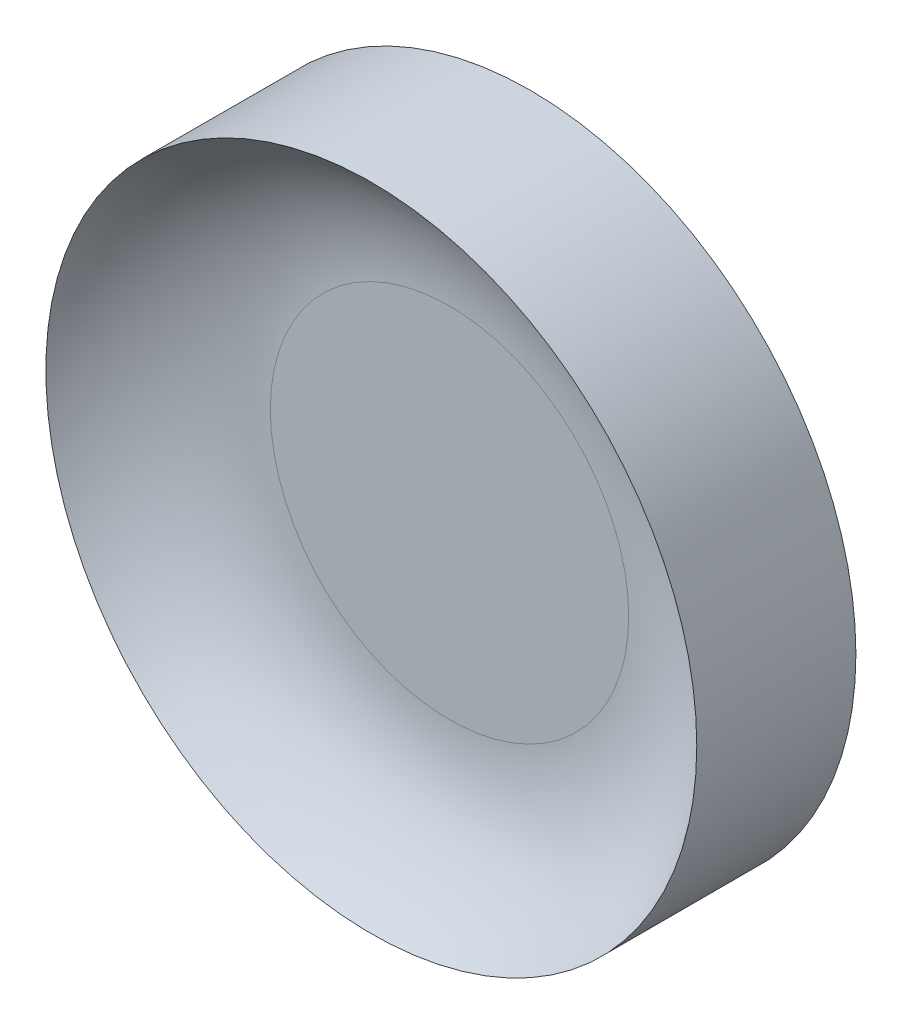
ISO-10303-21;
HEADER;
FILE_DESCRIPTION(('STEP AP214'),'2;1');
FILE_NAME('part.step','',(''),(''),'','','');
FILE_SCHEMA(('AUTOMOTIVE_DESIGN { 1 0 10303 214 1 1 1 1 }'));
ENDSEC;
DATA;
#1=APPLICATION_CONTEXT('core data for automotive mechanical design processes');
#2=APPLICATION_PROTOCOL_DEFINITION('international standard','automotive_design',2000,#1);
#3=PRODUCT_CONTEXT('',#1,'mechanical');
#4=PRODUCT('Part','Part','',(#3));
#5=PRODUCT_RELATED_PRODUCT_CATEGORY('part','',(#4));
#6=PRODUCT_DEFINITION_FORMATION('','',#4);
#7=PRODUCT_DEFINITION_CONTEXT('part definition',#1,'design');
#8=PRODUCT_DEFINITION('design','',#6,#7);
#9=PRODUCT_DEFINITION_SHAPE('','',#8);
#10=(LENGTH_UNIT() NAMED_UNIT(*) SI_UNIT(.MILLI.,.METRE.));
#11=(NAMED_UNIT(*) PLANE_ANGLE_UNIT() SI_UNIT($,.RADIAN.));
#12=(NAMED_UNIT(*) SI_UNIT($,.STERADIAN.) SOLID_ANGLE_UNIT());
#13=UNCERTAINTY_MEASURE_WITH_UNIT(LENGTH_MEASURE(1.E-05),#10,'distance_accuracy_value','');
#14=(GEOMETRIC_REPRESENTATION_CONTEXT(3) GLOBAL_UNCERTAINTY_ASSIGNED_CONTEXT((#13)) GLOBAL_UNIT_ASSIGNED_CONTEXT((#10,
#11,#12)) REPRESENTATION_CONTEXT('',''));
#15=CARTESIAN_POINT('',(0.,0.,0.));
#16=DIRECTION('',(0.,0.,1.));
#17=DIRECTION('',(1.,0.,0.));
#18=AXIS2_PLACEMENT_3D('',#15,#16,#17);
#19=CARTESIAN_POINT('',(0.,0.,-5.22725));
#20=DIRECTION('',(0.,0.,-1.));
#21=DIRECTION('',(-1.,0.,0.));
#22=AXIS2_PLACEMENT_3D('',#19,#20,#21);
#23=PLANE('',#22);
#24=CARTESIAN_POINT('',(0.,0.,-5.22725));
#25=DIRECTION('',(0.,0.,-1.));
#26=DIRECTION('',(-1.,0.,0.));
#27=AXIS2_PLACEMENT_3D('',#24,#25,#26);
#28=CIRCLE('',#27,9.37599017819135);
#29=CARTESIAN_POINT('',(-9.37599017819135,0.,-5.22725));
#30=VERTEX_POINT('',#29);
#31=EDGE_CURVE('E10',#30,#30,#28,.T.);
#32=ORIENTED_EDGE('',*,*,#31,.T.);
#33=EDGE_LOOP('',(#32));
#34=FACE_BOUND('',#33,.T.);
#35=ADVANCED_FACE('F26',(#34),#23,.T.);
#36=CARTESIAN_POINT('',(0.,0.,-7.25725));
#37=DIRECTION('',(0.,0.,-1.));
#38=DIRECTION('',(-1.,0.,0.));
#39=AXIS2_PLACEMENT_3D('',#36,#37,#38);
#40=TOROIDAL_SURFACE('',#39,9.37599017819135,2.03);
#41=ORIENTED_EDGE('',*,*,#31,.F.);
#42=EDGE_LOOP('',(#41));
#43=FACE_BOUND('',#42,.T.);
#44=CARTESIAN_POINT('',(0.,0.,-5.2272983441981));
#45=DIRECTION('',(0.,0.,-1.));
#46=DIRECTION('',(-1.,0.,0.));
#47=AXIS2_PLACEMENT_3D('',#44,#45,#46);
#48=CIRCLE('',#47,9.39);
#49=CARTESIAN_POINT('',(-9.39,0.,-5.2272983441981));
#50=VERTEX_POINT('',#49);
#51=EDGE_CURVE('E30',#50,#50,#48,.F.);
#52=ORIENTED_EDGE('',*,*,#51,.F.);
#53=EDGE_LOOP('',(#52));
#54=FACE_BOUND('',#53,.T.);
#55=ADVANCED_FACE('F49',(#43,#54),#40,.F.);
#56=CARTESIAN_POINT('',(0.,0.,-15.));
#57=DIRECTION('',(0.,0.,1.));
#58=DIRECTION('',(1.,0.,0.));
#59=AXIS2_PLACEMENT_3D('',#56,#57,#58);
#60=CYLINDRICAL_SURFACE('',#59,9.39);
#61=ORIENTED_EDGE('',*,*,#51,.T.);
#62=EDGE_LOOP('',(#61));
#63=FACE_BOUND('',#62,.T.);
#64=CARTESIAN_POINT('',(0.,0.,-0.636795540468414));
#65=DIRECTION('',(0.,0.,1.));
#66=DIRECTION('',(1.,0.,0.));
#67=AXIS2_PLACEMENT_3D('',#64,#65,#66);
#68=CIRCLE('',#67,9.39);
#69=CARTESIAN_POINT('',(9.39,0.,-0.636795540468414));
#70=VERTEX_POINT('',#69);
#71=EDGE_CURVE('E38',#70,#70,#68,.F.);
#72=ORIENTED_EDGE('',*,*,#71,.T.);
#73=EDGE_LOOP('',(#72));
#74=FACE_BOUND('',#73,.T.);
#75=ADVANCED_FACE('F47',(#63,#74),#60,.T.);
#76=CARTESIAN_POINT('',(0.,0.,2.18225));
#77=DIRECTION('',(0.,0.,1.));
#78=DIRECTION('',(1.,0.,0.));
#79=AXIS2_PLACEMENT_3D('',#76,#77,#78);
#80=TOROIDAL_SURFACE('',#79,5.16997544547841,5.075);
#81=CARTESIAN_POINT('',(0.,0.,-2.89275));
#82=DIRECTION('',(0.,0.,1.));
#83=DIRECTION('',(1.,0.,0.));
#84=AXIS2_PLACEMENT_3D('',#81,#82,#83);
#85=CIRCLE('',#84,5.16997544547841);
#86=CARTESIAN_POINT('',(5.16997544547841,0.,-2.89275));
#87=VERTEX_POINT('',#86);
#88=EDGE_CURVE('E34',#87,#87,#85,.T.);
#89=ORIENTED_EDGE('',*,*,#88,.F.);
#90=EDGE_LOOP('',(#89));
#91=FACE_BOUND('',#90,.T.);
#92=ORIENTED_EDGE('',*,*,#71,.F.);
#93=EDGE_LOOP('',(#92));
#94=FACE_BOUND('',#93,.T.);
#95=ADVANCED_FACE('F57',(#91,#94),#80,.F.);
#96=CARTESIAN_POINT('',(0.,0.,-2.89275));
#97=DIRECTION('',(0.,0.,1.));
#98=DIRECTION('',(1.,0.,0.));
#99=AXIS2_PLACEMENT_3D('',#96,#97,#98);
#100=PLANE('',#99);
#101=ORIENTED_EDGE('',*,*,#88,.T.);
#102=EDGE_LOOP('',(#101));
#103=FACE_BOUND('',#102,.T.);
#104=ADVANCED_FACE('F28',(#103),#100,.T.);
#105=CLOSED_SHELL('',(#35,#55,#75,#95,#104));
#106=MANIFOLD_SOLID_BREP('B2',#105);
#107=ADVANCED_BREP_SHAPE_REPRESENTATION('',(#18,#106),#14);
#108=SHAPE_DEFINITION_REPRESENTATION(#9,#107);
ENDSEC;
END-ISO-10303-21;
